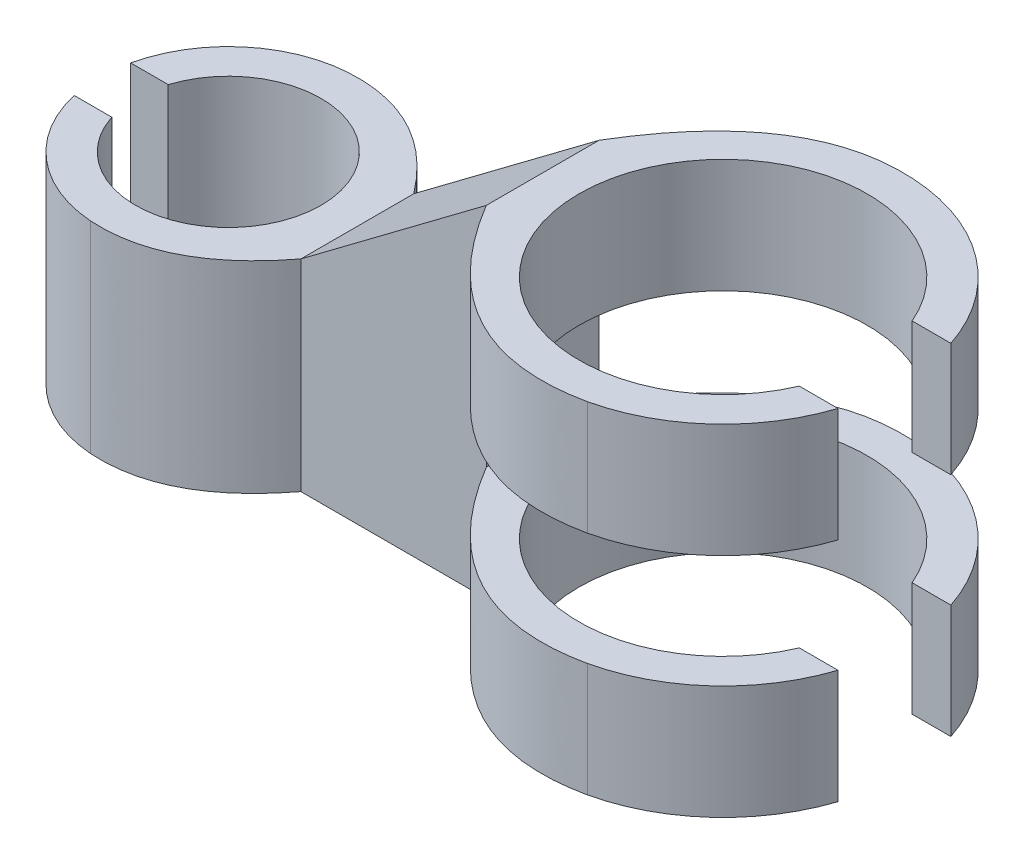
ISO-10303-21;
HEADER;
FILE_DESCRIPTION(('STEP AP214'),'2;1');
FILE_NAME('part.step','',(''),(''),'','','');
FILE_SCHEMA(('AUTOMOTIVE_DESIGN { 1 0 10303 214 1 1 1 1 }'));
ENDSEC;
DATA;
#1=APPLICATION_CONTEXT('core data for automotive mechanical design processes');
#2=APPLICATION_PROTOCOL_DEFINITION('international standard','automotive_design',2000,#1);
#3=PRODUCT_CONTEXT('',#1,'mechanical');
#4=PRODUCT('Part','Part','',(#3));
#5=PRODUCT_RELATED_PRODUCT_CATEGORY('part','',(#4));
#6=PRODUCT_DEFINITION_FORMATION('','',#4);
#7=PRODUCT_DEFINITION_CONTEXT('part definition',#1,'design');
#8=PRODUCT_DEFINITION('design','',#6,#7);
#9=PRODUCT_DEFINITION_SHAPE('','',#8);
#10=(LENGTH_UNIT() NAMED_UNIT(*) SI_UNIT(.MILLI.,.METRE.));
#11=(NAMED_UNIT(*) PLANE_ANGLE_UNIT() SI_UNIT($,.RADIAN.));
#12=(NAMED_UNIT(*) SI_UNIT($,.STERADIAN.) SOLID_ANGLE_UNIT());
#13=UNCERTAINTY_MEASURE_WITH_UNIT(LENGTH_MEASURE(1.E-05),#10,'distance_accuracy_value','');
#14=(GEOMETRIC_REPRESENTATION_CONTEXT(3) GLOBAL_UNCERTAINTY_ASSIGNED_CONTEXT((#13)) GLOBAL_UNIT_ASSIGNED_CONTEXT((#10,
#11,#12)) REPRESENTATION_CONTEXT('',''));
#15=CARTESIAN_POINT('',(0.,0.,0.));
#16=DIRECTION('',(0.,0.,1.));
#17=DIRECTION('',(1.,0.,0.));
#18=AXIS2_PLACEMENT_3D('',#15,#16,#17);
#19=CARTESIAN_POINT('',(20.4539037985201,16.9,2.33797950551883));
#20=DIRECTION('',(0.,-1.,0.));
#21=DIRECTION('',(0.,0.,-1.));
#22=AXIS2_PLACEMENT_3D('',#19,#20,#21);
#23=CYLINDRICAL_SURFACE('',#22,8.95);
#24=CARTESIAN_POINT('',(20.4539037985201,5.65,2.33797950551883));
#25=DIRECTION('',(0.,1.,0.));
#26=DIRECTION('',(0.,0.,1.));
#27=AXIS2_PLACEMENT_3D('',#24,#25,#26);
#28=CIRCLE('',#27,8.95);
#29=CARTESIAN_POINT('',(28.9546390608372,5.65,-0.462020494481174));
#30=VERTEX_POINT('',#29);
#31=CARTESIAN_POINT('',(22.4537820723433,5.65,-6.38572308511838));
#32=VERTEX_POINT('',#31);
#33=EDGE_CURVE('E507',#30,#32,#28,.T.);
#34=ORIENTED_EDGE('',*,*,#33,.F.);
#35=DIRECTION('',(0.,-1.,0.));
#36=VECTOR('',#35,1.);
#37=CARTESIAN_POINT('',(28.9546390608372,16.9,-0.462020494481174));
#38=LINE('',#37,#36);
#39=CARTESIAN_POINT('',(28.9546390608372,0.,-0.462020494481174));
#40=VERTEX_POINT('',#39);
#41=EDGE_CURVE('E55',#30,#40,#38,.T.);
#42=ORIENTED_EDGE('',*,*,#41,.T.);
#43=CARTESIAN_POINT('',(20.4539037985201,0.,2.33797950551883));
#44=DIRECTION('',(0.,-1.,0.));
#45=DIRECTION('',(0.,0.,-1.));
#46=AXIS2_PLACEMENT_3D('',#43,#44,#45);
#47=CIRCLE('',#46,8.95);
#48=CARTESIAN_POINT('',(22.4537820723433,0.,-6.38572308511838));
#49=VERTEX_POINT('',#48);
#50=EDGE_CURVE('E248',#40,#49,#47,.F.);
#51=ORIENTED_EDGE('',*,*,#50,.T.);
#52=DIRECTION('',(0.,-1.,0.));
#53=VECTOR('',#52,1.);
#54=CARTESIAN_POINT('',(22.4537820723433,16.9,-6.38572308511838));
#55=LINE('',#54,#53);
#56=EDGE_CURVE('E225',#32,#49,#55,.T.);
#57=ORIENTED_EDGE('',*,*,#56,.F.);
#58=EDGE_LOOP('',(#34,#42,#51,#57));
#59=FACE_BOUND('',#58,.T.);
#60=ADVANCED_FACE('F39',(#59),#23,.T.);
#61=CARTESIAN_POINT('',(20.4539037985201,16.9,2.33797950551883));
#62=DIRECTION('',(0.,-1.,0.));
#63=DIRECTION('',(0.,0.,-1.));
#64=AXIS2_PLACEMENT_3D('',#61,#62,#63);
#65=CIRCLE('',#64,8.95);
#66=CARTESIAN_POINT('',(28.9546390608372,16.9,-0.462020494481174));
#67=VERTEX_POINT('',#66);
#68=CARTESIAN_POINT('',(22.4537820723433,16.9,-6.38572308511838));
#69=VERTEX_POINT('',#68);
#70=EDGE_CURVE('E230',#67,#69,#65,.F.);
#71=ORIENTED_EDGE('',*,*,#70,.F.);
#72=DIRECTION('',(0.,-1.,0.));
#73=VECTOR('',#72,1.);
#74=CARTESIAN_POINT('',(28.9546390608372,16.9,-0.462020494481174));
#75=LINE('',#74,#73);
#76=CARTESIAN_POINT('',(28.9546390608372,11.25,-0.462020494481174));
#77=VERTEX_POINT('',#76);
#78=EDGE_CURVE('E545',#67,#77,#75,.T.);
#79=ORIENTED_EDGE('',*,*,#78,.T.);
#80=CARTESIAN_POINT('',(20.4539037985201,11.25,2.33797950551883));
#81=DIRECTION('',(0.,1.,0.));
#82=DIRECTION('',(0.,0.,1.));
#83=AXIS2_PLACEMENT_3D('',#80,#81,#82);
#84=CIRCLE('',#83,8.95);
#85=CARTESIAN_POINT('',(22.4537820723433,11.25,-6.38572308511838));
#86=VERTEX_POINT('',#85);
#87=EDGE_CURVE('E417',#77,#86,#84,.T.);
#88=ORIENTED_EDGE('',*,*,#87,.T.);
#89=EDGE_CURVE('E228',#69,#86,#55,.T.);
#90=ORIENTED_EDGE('',*,*,#89,.F.);
#91=EDGE_LOOP('',(#71,#79,#88,#90));
#92=FACE_BOUND('',#91,.T.);
#93=ADVANCED_FACE('F306',(#92),#23,.T.);
#94=CARTESIAN_POINT('',(-4.09609620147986,10.,2.33797950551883));
#95=DIRECTION('',(0.,-1.,0.));
#96=DIRECTION('',(0.,0.,-1.));
#97=AXIS2_PLACEMENT_3D('',#94,#95,#96);
#98=CYLINDRICAL_SURFACE('',#97,6.4);
#99=CARTESIAN_POINT('',(-4.09609620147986,0.,2.33797950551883));
#100=DIRECTION('',(0.,1.,0.));
#101=DIRECTION('',(0.,0.,1.));
#102=AXIS2_PLACEMENT_3D('',#99,#100,#101);
#103=CIRCLE('',#102,6.4);
#104=CARTESIAN_POINT('',(-4.53794079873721,0.,-4.0467501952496));
#105=VERTEX_POINT('',#104);
#106=CARTESIAN_POINT('',(-10.3410941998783,0.,0.937979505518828));
#107=VERTEX_POINT('',#106);
#108=EDGE_CURVE('E382',#105,#107,#103,.T.);
#109=ORIENTED_EDGE('',*,*,#108,.T.);
#110=DIRECTION('',(0.,-1.,0.));
#111=VECTOR('',#110,1.);
#112=CARTESIAN_POINT('',(-10.3410941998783,10.,0.937979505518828));
#113=LINE('',#112,#111);
#114=CARTESIAN_POINT('',(-10.3410941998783,10.,0.937979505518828));
#115=VERTEX_POINT('',#114);
#116=EDGE_CURVE('E476',#107,#115,#113,.F.);
#117=ORIENTED_EDGE('',*,*,#116,.T.);
#118=CARTESIAN_POINT('',(-4.09609620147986,10.,2.33797950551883));
#119=DIRECTION('',(0.,1.,0.));
#120=DIRECTION('',(0.,0.,1.));
#121=AXIS2_PLACEMENT_3D('',#118,#119,#120);
#122=CIRCLE('',#121,6.4);
#123=CARTESIAN_POINT('',(-4.53794079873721,10.,-4.0467501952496));
#124=VERTEX_POINT('',#123);
#125=EDGE_CURVE('E280',#124,#115,#122,.T.);
#126=ORIENTED_EDGE('',*,*,#125,.F.);
#127=DIRECTION('',(0.,-1.,0.));
#128=VECTOR('',#127,1.);
#129=CARTESIAN_POINT('',(-4.53794079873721,10.,-4.0467501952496));
#130=LINE('',#129,#128);
#131=EDGE_CURVE('E393',#124,#105,#130,.T.);
#132=ORIENTED_EDGE('',*,*,#131,.T.);
#133=EDGE_LOOP('',(#109,#117,#126,#132));
#134=FACE_BOUND('',#133,.T.);
#135=ADVANCED_FACE('F313',(#134),#98,.T.);
#136=CARTESIAN_POINT('',(11.5039037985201,16.9,5.13797950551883));
#137=CARTESIAN_POINT('',(15.8880562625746,16.9,12.4683931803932));
#138=CARTESIAN_POINT('',(22.4537820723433,16.9,11.061682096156));
#139=B_SPLINE_CURVE_WITH_KNOTS('',2,(#136,#137,#138),.UNSPECIFIED.,.F.,.F.,(3,3),(0.,1.),.UNSPECIFIED.);
#140=DIRECTION('',(0.,-1.,0.));
#141=VECTOR('',#140,1.);
#142=SURFACE_OF_LINEAR_EXTRUSION('',#139,#141);
#143=CARTESIAN_POINT('',(11.5039037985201,5.65,5.13797950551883));
#144=CARTESIAN_POINT('',(15.8880562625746,5.65,12.4683931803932));
#145=CARTESIAN_POINT('',(22.4537820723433,5.65,11.061682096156));
#146=B_SPLINE_CURVE_WITH_KNOTS('',2,(#143,#144,#145),.UNSPECIFIED.,.F.,.F.,(3,3),(0.,1.),.UNSPECIFIED.);
#147=CARTESIAN_POINT('',(11.5039037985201,5.65,5.13797950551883));
#148=VERTEX_POINT('',#147);
#149=CARTESIAN_POINT('',(22.4537820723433,5.65,11.061682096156));
#150=VERTEX_POINT('',#149);
#151=EDGE_CURVE('E358',#148,#150,#146,.T.);
#152=ORIENTED_EDGE('',*,*,#151,.F.);
#153=DIRECTION('',(0.,-1.,0.));
#154=VECTOR('',#153,1.);
#155=CARTESIAN_POINT('',(11.5039037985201,10.,5.13797950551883));
#156=LINE('',#155,#154);
#157=CARTESIAN_POINT('',(11.5039037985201,0.,5.13797950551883));
#158=VERTEX_POINT('',#157);
#159=EDGE_CURVE('E357',#148,#158,#156,.T.);
#160=ORIENTED_EDGE('',*,*,#159,.T.);
#161=CARTESIAN_POINT('',(11.5039037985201,0.,5.13797950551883));
#162=CARTESIAN_POINT('',(15.8880562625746,0.,12.4683931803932));
#163=CARTESIAN_POINT('',(22.4537820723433,0.,11.061682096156));
#164=B_SPLINE_CURVE_WITH_KNOTS('',2,(#161,#162,#163),.UNSPECIFIED.,.F.,.F.,(3,3),(0.,1.),.UNSPECIFIED.);
#165=CARTESIAN_POINT('',(22.4537820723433,0.,11.061682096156));
#166=VERTEX_POINT('',#165);
#167=EDGE_CURVE('E234',#158,#166,#164,.T.);
#168=ORIENTED_EDGE('',*,*,#167,.T.);
#169=DIRECTION('',(0.,-1.,0.));
#170=VECTOR('',#169,1.);
#171=CARTESIAN_POINT('',(22.4537820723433,16.9,11.061682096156));
#172=LINE('',#171,#170);
#173=EDGE_CURVE('E262',#150,#166,#172,.T.);
#174=ORIENTED_EDGE('',*,*,#173,.F.);
#175=EDGE_LOOP('',(#152,#160,#168,#174));
#176=FACE_BOUND('',#175,.T.);
#177=ADVANCED_FACE('F332',(#176),#142,.F.);
#178=CARTESIAN_POINT('',(28.9546390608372,0.,5.13797950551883));
#179=VERTEX_POINT('',#178);
#180=EDGE_CURVE('E249',#166,#179,#47,.F.);
#181=ORIENTED_EDGE('',*,*,#180,.T.);
#182=DIRECTION('',(0.,-1.,0.));
#183=VECTOR('',#182,1.);
#184=CARTESIAN_POINT('',(28.9546390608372,16.9,5.13797950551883));
#185=LINE('',#184,#183);
#186=CARTESIAN_POINT('',(28.9546390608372,5.65,5.13797950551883));
#187=VERTEX_POINT('',#186);
#188=EDGE_CURVE('E345',#179,#187,#185,.F.);
#189=ORIENTED_EDGE('',*,*,#188,.T.);
#190=EDGE_CURVE('E508',#150,#187,#28,.T.);
#191=ORIENTED_EDGE('',*,*,#190,.F.);
#192=ORIENTED_EDGE('',*,*,#173,.T.);
#193=EDGE_LOOP('',(#181,#189,#191,#192));
#194=FACE_BOUND('',#193,.T.);
#195=ADVANCED_FACE('F315',(#194),#23,.T.);
#196=CARTESIAN_POINT('',(11.5039037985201,16.9,-0.462020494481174));
#197=CARTESIAN_POINT('',(15.8880562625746,16.9,-7.7924341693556));
#198=CARTESIAN_POINT('',(22.4537820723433,16.9,-6.38572308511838));
#199=B_SPLINE_CURVE_WITH_KNOTS('',2,(#196,#197,#198),.UNSPECIFIED.,.F.,.F.,(3,3),(0.,1.),.UNSPECIFIED.);
#200=DIRECTION('',(0.,-1.,0.));
#201=VECTOR('',#200,1.);
#202=SURFACE_OF_LINEAR_EXTRUSION('',#199,#201);
#203=DIRECTION('',(0.,-1.,0.));
#204=VECTOR('',#203,1.);
#205=CARTESIAN_POINT('',(11.5039037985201,10.,-0.462020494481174));
#206=LINE('',#205,#204);
#207=CARTESIAN_POINT('',(11.5039037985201,5.65,-0.462020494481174));
#208=VERTEX_POINT('',#207);
#209=CARTESIAN_POINT('',(11.5039037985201,0.,-0.462020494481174));
#210=VERTEX_POINT('',#209);
#211=EDGE_CURVE('E399',#208,#210,#206,.T.);
#212=ORIENTED_EDGE('',*,*,#211,.F.);
#213=CARTESIAN_POINT('',(22.4537820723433,5.65,-6.38572308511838));
#214=CARTESIAN_POINT('',(15.8880562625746,5.65,-7.7924341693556));
#215=CARTESIAN_POINT('',(11.5039037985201,5.65,-0.462020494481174));
#216=B_SPLINE_CURVE_WITH_KNOTS('',2,(#213,#214,#215),.UNSPECIFIED.,.F.,.F.,(3,3),(0.,1.),.UNSPECIFIED.);
#217=EDGE_CURVE('E439',#32,#208,#216,.T.);
#218=ORIENTED_EDGE('',*,*,#217,.F.);
#219=ORIENTED_EDGE('',*,*,#56,.T.);
#220=CARTESIAN_POINT('',(11.5039037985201,0.,-0.462020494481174));
#221=CARTESIAN_POINT('',(15.8880562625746,0.,-7.7924341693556));
#222=CARTESIAN_POINT('',(22.4537820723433,0.,-6.38572308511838));
#223=B_SPLINE_CURVE_WITH_KNOTS('',2,(#220,#221,#222),.UNSPECIFIED.,.F.,.F.,(3,3),(0.,1.),.UNSPECIFIED.);
#224=EDGE_CURVE('E239',#210,#49,#223,.T.);
#225=ORIENTED_EDGE('',*,*,#224,.F.);
#226=EDGE_LOOP('',(#212,#218,#219,#225));
#227=FACE_BOUND('',#226,.T.);
#228=ADVANCED_FACE('F328',(#227),#202,.T.);
#229=CARTESIAN_POINT('',(20.4539037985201,16.9,2.33797950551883));
#230=DIRECTION('',(0.,-1.,0.));
#231=DIRECTION('',(0.,0.,-1.));
#232=AXIS2_PLACEMENT_3D('',#229,#230,#231);
#233=CYLINDRICAL_SURFACE('',#232,7.15);
#234=CARTESIAN_POINT('',(20.4539037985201,0.,2.33797950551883));
#235=DIRECTION('',(0.,-1.,0.));
#236=DIRECTION('',(0.,0.,-1.));
#237=AXIS2_PLACEMENT_3D('',#234,#235,#236);
#238=CIRCLE('',#237,7.15);
#239=CARTESIAN_POINT('',(27.0328474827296,0.,5.13797950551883));
#240=VERTEX_POINT('',#239);
#241=CARTESIAN_POINT('',(27.0328474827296,0.,-0.462020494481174));
#242=VERTEX_POINT('',#241);
#243=EDGE_CURVE('E255',#240,#242,#238,.T.);
#244=ORIENTED_EDGE('',*,*,#243,.T.);
#245=DIRECTION('',(0.,-1.,0.));
#246=VECTOR('',#245,1.);
#247=CARTESIAN_POINT('',(27.0328474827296,16.9,-0.462020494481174));
#248=LINE('',#247,#246);
#249=CARTESIAN_POINT('',(27.0328474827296,5.65,-0.462020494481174));
#250=VERTEX_POINT('',#249);
#251=EDGE_CURVE('E555',#242,#250,#248,.F.);
#252=ORIENTED_EDGE('',*,*,#251,.T.);
#253=CARTESIAN_POINT('',(20.4539037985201,5.65,2.33797950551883));
#254=DIRECTION('',(0.,1.,0.));
#255=DIRECTION('',(0.,0.,1.));
#256=AXIS2_PLACEMENT_3D('',#253,#254,#255);
#257=CIRCLE('',#256,7.15);
#258=CARTESIAN_POINT('',(27.0328474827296,5.65,5.13797950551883));
#259=VERTEX_POINT('',#258);
#260=EDGE_CURVE('E420',#259,#250,#257,.F.);
#261=ORIENTED_EDGE('',*,*,#260,.F.);
#262=DIRECTION('',(0.,-1.,0.));
#263=VECTOR('',#262,1.);
#264=CARTESIAN_POINT('',(27.0328474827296,16.9,5.13797950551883));
#265=LINE('',#264,#263);
#266=EDGE_CURVE('E63',#259,#240,#265,.T.);
#267=ORIENTED_EDGE('',*,*,#266,.T.);
#268=EDGE_LOOP('',(#244,#252,#261,#267));
#269=FACE_BOUND('',#268,.T.);
#270=ADVANCED_FACE('F302',(#269),#233,.F.);
#271=CARTESIAN_POINT('',(2.30390379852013,10.,5.13797950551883));
#272=CARTESIAN_POINT('',(-0.619440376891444,10.,8.97316679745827));
#273=CARTESIAN_POINT('',(-4.53794079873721,10.,8.72270920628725));
#274=B_SPLINE_CURVE_WITH_KNOTS('',2,(#271,#272,#273),.UNSPECIFIED.,.F.,.F.,(3,3),(0.,1.),.UNSPECIFIED.);
#275=DIRECTION('',(0.,-1.,0.));
#276=VECTOR('',#275,1.);
#277=SURFACE_OF_LINEAR_EXTRUSION('',#274,#276);
#278=CARTESIAN_POINT('',(2.30390379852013,0.,5.13797950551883));
#279=CARTESIAN_POINT('',(-0.619440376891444,0.,8.97316679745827));
#280=CARTESIAN_POINT('',(-4.53794079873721,0.,8.72270920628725));
#281=B_SPLINE_CURVE_WITH_KNOTS('',2,(#278,#279,#280),.UNSPECIFIED.,.F.,.F.,(3,3),(0.,1.),.UNSPECIFIED.);
#282=CARTESIAN_POINT('',(2.30390379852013,0.,5.13797950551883));
#283=VERTEX_POINT('',#282);
#284=CARTESIAN_POINT('',(-4.53794079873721,0.,8.72270920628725));
#285=VERTEX_POINT('',#284);
#286=EDGE_CURVE('E261',#283,#285,#281,.T.);
#287=ORIENTED_EDGE('',*,*,#286,.F.);
#288=DIRECTION('',(0.,-1.,0.));
#289=VECTOR('',#288,1.);
#290=CARTESIAN_POINT('',(2.30390379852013,10.,5.13797950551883));
#291=LINE('',#290,#289);
#292=CARTESIAN_POINT('',(2.30390379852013,10.,5.13797950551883));
#293=VERTEX_POINT('',#292);
#294=EDGE_CURVE('E366',#293,#283,#291,.T.);
#295=ORIENTED_EDGE('',*,*,#294,.F.);
#296=CARTESIAN_POINT('',(-4.53794079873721,10.,8.72270920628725));
#297=VERTEX_POINT('',#296);
#298=EDGE_CURVE('E264',#293,#297,#274,.T.);
#299=ORIENTED_EDGE('',*,*,#298,.T.);
#300=DIRECTION('',(0.,-1.,0.));
#301=VECTOR('',#300,1.);
#302=CARTESIAN_POINT('',(-4.53794079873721,10.,8.72270920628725));
#303=LINE('',#302,#301);
#304=EDGE_CURVE('E390',#297,#285,#303,.T.);
#305=ORIENTED_EDGE('',*,*,#304,.T.);
#306=EDGE_LOOP('',(#287,#295,#299,#305));
#307=FACE_BOUND('',#306,.T.);
#308=ADVANCED_FACE('F41',(#307),#277,.T.);
#309=CARTESIAN_POINT('',(0.,10.,5.13797950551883));
#310=DIRECTION('',(0.,0.,-1.));
#311=DIRECTION('',(-1.,0.,0.));
#312=AXIS2_PLACEMENT_3D('',#309,#310,#311);
#313=PLANE('',#312);
#314=DIRECTION('',(1.,0.,0.));
#315=VECTOR('',#314,1.);
#316=CARTESIAN_POINT('',(0.,0.,5.13797950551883));
#317=LINE('',#316,#315);
#318=EDGE_CURVE('E363',#283,#158,#317,.T.);
#319=ORIENTED_EDGE('',*,*,#318,.T.);
#320=ORIENTED_EDGE('',*,*,#159,.F.);
#321=DIRECTION('',(0.,1.,0.));
#322=VECTOR('',#321,1.);
#323=CARTESIAN_POINT('',(11.5039037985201,5.65,5.13797950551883));
#324=LINE('',#323,#322);
#325=CARTESIAN_POINT('',(11.5039037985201,11.25,5.13797950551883));
#326=VERTEX_POINT('',#325);
#327=EDGE_CURVE('E437',#148,#326,#324,.T.);
#328=ORIENTED_EDGE('',*,*,#327,.T.);
#329=CARTESIAN_POINT('',(11.5039037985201,16.9,5.13797950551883));
#330=VERTEX_POINT('',#329);
#331=EDGE_CURVE('E360',#330,#326,#156,.T.);
#332=ORIENTED_EDGE('',*,*,#331,.F.);
#333=DIRECTION('',(0.8,0.6,0.));
#334=VECTOR('',#333,1.);
#335=CARTESIAN_POINT('',(2.30390379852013,10.,5.13797950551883));
#336=LINE('',#335,#334);
#337=EDGE_CURVE('E440',#293,#330,#336,.T.);
#338=ORIENTED_EDGE('',*,*,#337,.F.);
#339=ORIENTED_EDGE('',*,*,#294,.T.);
#340=EDGE_LOOP('',(#319,#320,#328,#332,#338,#339));
#341=FACE_BOUND('',#340,.T.);
#342=ADVANCED_FACE('F295',(#341),#313,.F.);
#343=CARTESIAN_POINT('',(0.,10.,-0.462020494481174));
#344=DIRECTION('',(0.,0.,-1.));
#345=DIRECTION('',(-1.,0.,0.));
#346=AXIS2_PLACEMENT_3D('',#343,#344,#345);
#347=PLANE('',#346);
#348=DIRECTION('',(1.,0.,0.));
#349=VECTOR('',#348,1.);
#350=CARTESIAN_POINT('',(0.,0.,-0.462020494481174));
#351=LINE('',#350,#349);
#352=CARTESIAN_POINT('',(2.30390379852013,0.,-0.462020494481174));
#353=VERTEX_POINT('',#352);
#354=EDGE_CURVE('E369',#353,#210,#351,.T.);
#355=ORIENTED_EDGE('',*,*,#354,.F.);
#356=DIRECTION('',(0.,-1.,0.));
#357=VECTOR('',#356,1.);
#358=CARTESIAN_POINT('',(2.30390379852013,10.,-0.462020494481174));
#359=LINE('',#358,#357);
#360=CARTESIAN_POINT('',(2.30390379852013,10.,-0.462020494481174));
#361=VERTEX_POINT('',#360);
#362=EDGE_CURVE('E397',#361,#353,#359,.T.);
#363=ORIENTED_EDGE('',*,*,#362,.F.);
#364=DIRECTION('',(0.8,0.6,0.));
#365=VECTOR('',#364,1.);
#366=CARTESIAN_POINT('',(2.30390379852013,10.,-0.462020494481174));
#367=LINE('',#366,#365);
#368=CARTESIAN_POINT('',(11.5039037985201,16.9,-0.462020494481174));
#369=VERTEX_POINT('',#368);
#370=EDGE_CURVE('E436',#361,#369,#367,.T.);
#371=ORIENTED_EDGE('',*,*,#370,.T.);
#372=CARTESIAN_POINT('',(11.5039037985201,11.25,-0.462020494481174));
#373=VERTEX_POINT('',#372);
#374=EDGE_CURVE('E361',#369,#373,#206,.T.);
#375=ORIENTED_EDGE('',*,*,#374,.T.);
#376=DIRECTION('',(0.,1.,0.));
#377=VECTOR('',#376,1.);
#378=CARTESIAN_POINT('',(11.5039037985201,5.65,-0.462020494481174));
#379=LINE('',#378,#377);
#380=EDGE_CURVE('E430',#208,#373,#379,.T.);
#381=ORIENTED_EDGE('',*,*,#380,.F.);
#382=ORIENTED_EDGE('',*,*,#211,.T.);
#383=EDGE_LOOP('',(#355,#363,#371,#375,#381,#382));
#384=FACE_BOUND('',#383,.T.);
#385=ADVANCED_FACE('F291',(#384),#347,.T.);
#386=CARTESIAN_POINT('',(2.30390379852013,10.,-0.462020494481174));
#387=CARTESIAN_POINT('',(-0.619440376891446,10.,-4.29720778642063));
#388=CARTESIAN_POINT('',(-4.53794079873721,10.,-4.0467501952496));
#389=B_SPLINE_CURVE_WITH_KNOTS('',2,(#386,#387,#388),.UNSPECIFIED.,.F.,.F.,(3,3),(0.,1.),.UNSPECIFIED.);
#390=DIRECTION('',(0.,-1.,0.));
#391=VECTOR('',#390,1.);
#392=SURFACE_OF_LINEAR_EXTRUSION('',#389,#391);
#393=CARTESIAN_POINT('',(2.30390379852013,0.,-0.462020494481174));
#394=CARTESIAN_POINT('',(-0.619440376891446,0.,-4.29720778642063));
#395=CARTESIAN_POINT('',(-4.53794079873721,0.,-4.0467501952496));
#396=B_SPLINE_CURVE_WITH_KNOTS('',2,(#393,#394,#395),.UNSPECIFIED.,.F.,.F.,(3,3),(0.,1.),.UNSPECIFIED.);
#397=EDGE_CURVE('E372',#353,#105,#396,.T.);
#398=ORIENTED_EDGE('',*,*,#397,.T.);
#399=ORIENTED_EDGE('',*,*,#131,.F.);
#400=EDGE_CURVE('E270',#361,#124,#389,.T.);
#401=ORIENTED_EDGE('',*,*,#400,.F.);
#402=ORIENTED_EDGE('',*,*,#362,.T.);
#403=EDGE_LOOP('',(#398,#399,#401,#402));
#404=FACE_BOUND('',#403,.T.);
#405=ADVANCED_FACE('F286',(#404),#392,.F.);
#406=CARTESIAN_POINT('',(-10.3410941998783,10.,3.73797950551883));
#407=VERTEX_POINT('',#406);
#408=EDGE_CURVE('E279',#407,#297,#122,.T.);
#409=ORIENTED_EDGE('',*,*,#408,.F.);
#410=DIRECTION('',(0.,-1.,0.));
#411=VECTOR('',#410,1.);
#412=CARTESIAN_POINT('',(-10.3410941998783,10.,3.73797950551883));
#413=LINE('',#412,#411);
#414=CARTESIAN_POINT('',(-10.3410941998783,0.,3.73797950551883));
#415=VERTEX_POINT('',#414);
#416=EDGE_CURVE('E484',#407,#415,#413,.T.);
#417=ORIENTED_EDGE('',*,*,#416,.T.);
#418=EDGE_CURVE('E381',#415,#285,#103,.T.);
#419=ORIENTED_EDGE('',*,*,#418,.T.);
#420=ORIENTED_EDGE('',*,*,#304,.F.);
#421=EDGE_LOOP('',(#409,#417,#419,#420));
#422=FACE_BOUND('',#421,.T.);
#423=ADVANCED_FACE('F290',(#422),#98,.T.);
#424=CARTESIAN_POINT('',(-4.09609620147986,10.,2.33797950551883));
#425=DIRECTION('',(0.,-1.,0.));
#426=DIRECTION('',(0.,0.,-1.));
#427=AXIS2_PLACEMENT_3D('',#424,#425,#426);
#428=CYLINDRICAL_SURFACE('',#427,4.6);
#429=DIRECTION('',(0.,-1.,0.));
#430=VECTOR('',#429,1.);
#431=CARTESIAN_POINT('',(-8.47787666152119,10.,0.937979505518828));
#432=LINE('',#431,#430);
#433=CARTESIAN_POINT('',(-8.47787666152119,0.,0.937979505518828));
#434=VERTEX_POINT('',#433);
#435=CARTESIAN_POINT('',(-8.47787666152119,10.,0.937979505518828));
#436=VERTEX_POINT('',#435);
#437=EDGE_CURVE('E471',#434,#436,#432,.F.);
#438=ORIENTED_EDGE('',*,*,#437,.F.);
#439=CARTESIAN_POINT('',(-4.09609620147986,0.,2.33797950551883));
#440=DIRECTION('',(0.,1.,0.));
#441=DIRECTION('',(0.,0.,1.));
#442=AXIS2_PLACEMENT_3D('',#439,#440,#441);
#443=CIRCLE('',#442,4.6);
#444=CARTESIAN_POINT('',(-8.47787666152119,0.,3.73797950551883));
#445=VERTEX_POINT('',#444);
#446=EDGE_CURVE('E271',#445,#434,#443,.T.);
#447=ORIENTED_EDGE('',*,*,#446,.F.);
#448=DIRECTION('',(0.,-1.,0.));
#449=VECTOR('',#448,1.);
#450=CARTESIAN_POINT('',(-8.47787666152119,10.,3.73797950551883));
#451=LINE('',#450,#449);
#452=CARTESIAN_POINT('',(-8.47787666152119,10.,3.73797950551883));
#453=VERTEX_POINT('',#452);
#454=EDGE_CURVE('E486',#453,#445,#451,.T.);
#455=ORIENTED_EDGE('',*,*,#454,.F.);
#456=CARTESIAN_POINT('',(-4.09609620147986,10.,2.33797950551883));
#457=DIRECTION('',(0.,1.,0.));
#458=DIRECTION('',(0.,0.,1.));
#459=AXIS2_PLACEMENT_3D('',#456,#457,#458);
#460=CIRCLE('',#459,4.6);
#461=EDGE_CURVE('E394',#453,#436,#460,.T.);
#462=ORIENTED_EDGE('',*,*,#461,.T.);
#463=EDGE_LOOP('',(#438,#447,#455,#462));
#464=FACE_BOUND('',#463,.T.);
#465=ADVANCED_FACE('F459',(#464),#428,.F.);
#466=CARTESIAN_POINT('',(0.,10.,0.));
#467=DIRECTION('',(0.,1.,0.));
#468=DIRECTION('',(0.,0.,1.));
#469=AXIS2_PLACEMENT_3D('',#466,#467,#468);
#470=PLANE('',#469);
#471=DIRECTION('',(-1.,0.,0.));
#472=VECTOR('',#471,1.);
#473=CARTESIAN_POINT('',(0.,10.,0.937979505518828));
#474=LINE('',#473,#472);
#475=EDGE_CURVE('E497',#436,#115,#474,.T.);
#476=ORIENTED_EDGE('',*,*,#475,.F.);
#477=ORIENTED_EDGE('',*,*,#461,.F.);
#478=DIRECTION('',(1.,0.,0.));
#479=VECTOR('',#478,1.);
#480=CARTESIAN_POINT('',(0.,10.,3.73797950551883));
#481=LINE('',#480,#479);
#482=EDGE_CURVE('E477',#407,#453,#481,.T.);
#483=ORIENTED_EDGE('',*,*,#482,.F.);
#484=ORIENTED_EDGE('',*,*,#408,.T.);
#485=ORIENTED_EDGE('',*,*,#298,.F.);
#486=DIRECTION('',(0.,0.,-1.));
#487=VECTOR('',#486,1.);
#488=CARTESIAN_POINT('',(2.30390379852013,10.,5.13797950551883));
#489=LINE('',#488,#487);
#490=EDGE_CURVE('E240',#293,#361,#489,.T.);
#491=ORIENTED_EDGE('',*,*,#490,.T.);
#492=ORIENTED_EDGE('',*,*,#400,.T.);
#493=ORIENTED_EDGE('',*,*,#125,.T.);
#494=EDGE_LOOP('',(#476,#477,#483,#484,#485,#491,#492,#493));
#495=FACE_BOUND('',#494,.T.);
#496=ADVANCED_FACE('F456',(#495),#470,.T.);
#497=CARTESIAN_POINT('',(0.,0.,0.));
#498=DIRECTION('',(0.,1.,0.));
#499=DIRECTION('',(0.,0.,1.));
#500=AXIS2_PLACEMENT_3D('',#497,#498,#499);
#501=PLANE('',#500);
#502=ORIENTED_EDGE('',*,*,#50,.F.);
#503=DIRECTION('',(-1.,0.,0.));
#504=VECTOR('',#503,1.);
#505=CARTESIAN_POINT('',(0.,0.,-0.462020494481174));
#506=LINE('',#505,#504);
#507=EDGE_CURVE('E491',#40,#242,#506,.T.);
#508=ORIENTED_EDGE('',*,*,#507,.T.);
#509=ORIENTED_EDGE('',*,*,#243,.F.);
#510=DIRECTION('',(1.,0.,0.));
#511=VECTOR('',#510,1.);
#512=CARTESIAN_POINT('',(0.,0.,5.13797950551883));
#513=LINE('',#512,#511);
#514=EDGE_CURVE('E354',#240,#179,#513,.T.);
#515=ORIENTED_EDGE('',*,*,#514,.T.);
#516=ORIENTED_EDGE('',*,*,#180,.F.);
#517=ORIENTED_EDGE('',*,*,#167,.F.);
#518=ORIENTED_EDGE('',*,*,#318,.F.);
#519=ORIENTED_EDGE('',*,*,#286,.T.);
#520=ORIENTED_EDGE('',*,*,#418,.F.);
#521=DIRECTION('',(1.,0.,0.));
#522=VECTOR('',#521,1.);
#523=CARTESIAN_POINT('',(0.,0.,3.73797950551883));
#524=LINE('',#523,#522);
#525=EDGE_CURVE('E404',#415,#445,#524,.T.);
#526=ORIENTED_EDGE('',*,*,#525,.T.);
#527=ORIENTED_EDGE('',*,*,#446,.T.);
#528=DIRECTION('',(-1.,0.,0.));
#529=VECTOR('',#528,1.);
#530=CARTESIAN_POINT('',(0.,0.,0.937979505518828));
#531=LINE('',#530,#529);
#532=EDGE_CURVE('E407',#434,#107,#531,.T.);
#533=ORIENTED_EDGE('',*,*,#532,.T.);
#534=ORIENTED_EDGE('',*,*,#108,.F.);
#535=ORIENTED_EDGE('',*,*,#397,.F.);
#536=ORIENTED_EDGE('',*,*,#354,.T.);
#537=ORIENTED_EDGE('',*,*,#224,.T.);
#538=EDGE_LOOP('',(#502,#508,#509,#515,#516,#517,#518,#519,#520,#526,#527,#533,#534,#535,#536,#537));
#539=FACE_BOUND('',#538,.T.);
#540=ADVANCED_FACE('F329',(#539),#501,.F.);
#541=ORIENTED_EDGE('',*,*,#331,.T.);
#542=CARTESIAN_POINT('',(11.5039037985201,11.25,5.13797950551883));
#543=CARTESIAN_POINT('',(15.8880562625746,11.25,12.4683931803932));
#544=CARTESIAN_POINT('',(22.4537820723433,11.25,11.061682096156));
#545=B_SPLINE_CURVE_WITH_KNOTS('',2,(#542,#543,#544),.UNSPECIFIED.,.F.,.F.,(3,3),(0.,1.),.UNSPECIFIED.);
#546=CARTESIAN_POINT('',(22.4537820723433,11.25,11.061682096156));
#547=VERTEX_POINT('',#546);
#548=EDGE_CURVE('E422',#326,#547,#545,.T.);
#549=ORIENTED_EDGE('',*,*,#548,.T.);
#550=CARTESIAN_POINT('',(22.4537820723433,16.9,11.061682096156));
#551=VERTEX_POINT('',#550);
#552=EDGE_CURVE('E259',#551,#547,#172,.T.);
#553=ORIENTED_EDGE('',*,*,#552,.F.);
#554=EDGE_CURVE('E258',#330,#551,#139,.T.);
#555=ORIENTED_EDGE('',*,*,#554,.F.);
#556=EDGE_LOOP('',(#541,#549,#553,#555));
#557=FACE_BOUND('',#556,.T.);
#558=ADVANCED_FACE('F321',(#557),#142,.F.);
#559=CARTESIAN_POINT('',(28.9546390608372,11.25,5.13797950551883));
#560=VERTEX_POINT('',#559);
#561=EDGE_CURVE('E412',#547,#560,#84,.T.);
#562=ORIENTED_EDGE('',*,*,#561,.T.);
#563=DIRECTION('',(0.,-1.,0.));
#564=VECTOR('',#563,1.);
#565=CARTESIAN_POINT('',(28.9546390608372,16.9,5.13797950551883));
#566=LINE('',#565,#564);
#567=CARTESIAN_POINT('',(28.9546390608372,16.9,5.13797950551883));
#568=VERTEX_POINT('',#567);
#569=EDGE_CURVE('E210',#560,#568,#566,.F.);
#570=ORIENTED_EDGE('',*,*,#569,.T.);
#571=EDGE_CURVE('E220',#551,#568,#65,.F.);
#572=ORIENTED_EDGE('',*,*,#571,.F.);
#573=ORIENTED_EDGE('',*,*,#552,.T.);
#574=EDGE_LOOP('',(#562,#570,#572,#573));
#575=FACE_BOUND('',#574,.T.);
#576=ADVANCED_FACE('F309',(#575),#23,.T.);
#577=CARTESIAN_POINT('',(22.4537820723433,11.25,-6.38572308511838));
#578=CARTESIAN_POINT('',(15.8880562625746,11.25,-7.7924341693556));
#579=CARTESIAN_POINT('',(11.5039037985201,11.25,-0.462020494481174));
#580=B_SPLINE_CURVE_WITH_KNOTS('',2,(#577,#578,#579),.UNSPECIFIED.,.F.,.F.,(3,3),(0.,1.),.UNSPECIFIED.);
#581=EDGE_CURVE('E416',#86,#373,#580,.T.);
#582=ORIENTED_EDGE('',*,*,#581,.T.);
#583=ORIENTED_EDGE('',*,*,#374,.F.);
#584=EDGE_CURVE('E536',#369,#69,#199,.T.);
#585=ORIENTED_EDGE('',*,*,#584,.T.);
#586=ORIENTED_EDGE('',*,*,#89,.T.);
#587=EDGE_LOOP('',(#582,#583,#585,#586));
#588=FACE_BOUND('',#587,.T.);
#589=ADVANCED_FACE('F320',(#588),#202,.T.);
#590=CARTESIAN_POINT('',(20.4539037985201,11.25,2.33797950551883));
#591=DIRECTION('',(0.,1.,0.));
#592=DIRECTION('',(0.,0.,1.));
#593=AXIS2_PLACEMENT_3D('',#590,#591,#592);
#594=CIRCLE('',#593,7.15);
#595=CARTESIAN_POINT('',(27.0328474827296,11.25,5.13797950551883));
#596=VERTEX_POINT('',#595);
#597=CARTESIAN_POINT('',(27.0328474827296,11.25,-0.462020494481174));
#598=VERTEX_POINT('',#597);
#599=EDGE_CURVE('E414',#596,#598,#594,.F.);
#600=ORIENTED_EDGE('',*,*,#599,.T.);
#601=DIRECTION('',(0.,-1.,0.));
#602=VECTOR('',#601,1.);
#603=CARTESIAN_POINT('',(27.0328474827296,16.9,-0.462020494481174));
#604=LINE('',#603,#602);
#605=CARTESIAN_POINT('',(27.0328474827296,16.9,-0.462020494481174));
#606=VERTEX_POINT('',#605);
#607=EDGE_CURVE('E224',#598,#606,#604,.F.);
#608=ORIENTED_EDGE('',*,*,#607,.T.);
#609=CARTESIAN_POINT('',(20.4539037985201,16.9,2.33797950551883));
#610=DIRECTION('',(0.,-1.,0.));
#611=DIRECTION('',(0.,0.,-1.));
#612=AXIS2_PLACEMENT_3D('',#609,#610,#611);
#613=CIRCLE('',#612,7.15);
#614=CARTESIAN_POINT('',(27.0328474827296,16.9,5.13797950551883));
#615=VERTEX_POINT('',#614);
#616=EDGE_CURVE('E218',#615,#606,#613,.T.);
#617=ORIENTED_EDGE('',*,*,#616,.F.);
#618=DIRECTION('',(0.,-1.,0.));
#619=VECTOR('',#618,1.);
#620=CARTESIAN_POINT('',(27.0328474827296,16.9,5.13797950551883));
#621=LINE('',#620,#619);
#622=EDGE_CURVE('E200',#615,#596,#621,.T.);
#623=ORIENTED_EDGE('',*,*,#622,.T.);
#624=EDGE_LOOP('',(#600,#608,#617,#623));
#625=FACE_BOUND('',#624,.T.);
#626=ADVANCED_FACE('F223',(#625),#233,.F.);
#627=CARTESIAN_POINT('',(0.,16.9,0.));
#628=DIRECTION('',(0.,-1.,0.));
#629=DIRECTION('',(0.,0.,-1.));
#630=AXIS2_PLACEMENT_3D('',#627,#628,#629);
#631=PLANE('',#630);
#632=ORIENTED_EDGE('',*,*,#616,.T.);
#633=DIRECTION('',(-1.,0.,0.));
#634=VECTOR('',#633,1.);
#635=CARTESIAN_POINT('',(25.013022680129,16.9,-0.462020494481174));
#636=LINE('',#635,#634);
#637=EDGE_CURVE('E211',#67,#606,#636,.T.);
#638=ORIENTED_EDGE('',*,*,#637,.F.);
#639=ORIENTED_EDGE('',*,*,#70,.T.);
#640=ORIENTED_EDGE('',*,*,#584,.F.);
#641=DIRECTION('',(0.,0.,1.));
#642=VECTOR('',#641,1.);
#643=CARTESIAN_POINT('',(11.5039037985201,16.9,0.));
#644=LINE('',#643,#642);
#645=EDGE_CURVE('E451',#369,#330,#644,.T.);
#646=ORIENTED_EDGE('',*,*,#645,.T.);
#647=ORIENTED_EDGE('',*,*,#554,.T.);
#648=ORIENTED_EDGE('',*,*,#571,.T.);
#649=DIRECTION('',(1.,0.,0.));
#650=VECTOR('',#649,1.);
#651=CARTESIAN_POINT('',(25.013022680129,16.9,5.13797950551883));
#652=LINE('',#651,#650);
#653=EDGE_CURVE('E203',#615,#568,#652,.T.);
#654=ORIENTED_EDGE('',*,*,#653,.F.);
#655=EDGE_LOOP('',(#632,#638,#639,#640,#646,#647,#648,#654));
#656=FACE_BOUND('',#655,.T.);
#657=ADVANCED_FACE('F216',(#656),#631,.F.);
#658=CARTESIAN_POINT('',(2.30390379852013,10.,5.13797950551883));
#659=DIRECTION('',(-0.6,0.8,0.));
#660=DIRECTION('',(-0.8,-0.6,0.));
#661=AXIS2_PLACEMENT_3D('',#658,#659,#660);
#662=PLANE('',#661);
#663=ORIENTED_EDGE('',*,*,#370,.F.);
#664=ORIENTED_EDGE('',*,*,#490,.F.);
#665=ORIENTED_EDGE('',*,*,#337,.T.);
#666=ORIENTED_EDGE('',*,*,#645,.F.);
#667=EDGE_LOOP('',(#663,#664,#665,#666));
#668=FACE_BOUND('',#667,.T.);
#669=ADVANCED_FACE('F596',(#668),#662,.T.);
#670=CARTESIAN_POINT('',(11.5039037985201,5.65,0.));
#671=DIRECTION('',(-1.,0.,0.));
#672=DIRECTION('',(0.,0.,1.));
#673=AXIS2_PLACEMENT_3D('',#670,#671,#672);
#674=PLANE('',#673);
#675=DIRECTION('',(0.,0.,1.));
#676=VECTOR('',#675,1.);
#677=CARTESIAN_POINT('',(11.5039037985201,11.25,0.));
#678=LINE('',#677,#676);
#679=EDGE_CURVE('E520',#373,#326,#678,.T.);
#680=ORIENTED_EDGE('',*,*,#679,.T.);
#681=ORIENTED_EDGE('',*,*,#327,.F.);
#682=DIRECTION('',(0.,0.,1.));
#683=VECTOR('',#682,1.);
#684=CARTESIAN_POINT('',(11.5039037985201,5.65,0.));
#685=LINE('',#684,#683);
#686=EDGE_CURVE('E501',#208,#148,#685,.T.);
#687=ORIENTED_EDGE('',*,*,#686,.F.);
#688=ORIENTED_EDGE('',*,*,#380,.T.);
#689=EDGE_LOOP('',(#680,#681,#687,#688));
#690=FACE_BOUND('',#689,.T.);
#691=ADVANCED_FACE('F526',(#690),#674,.F.);
#692=CARTESIAN_POINT('',(0.,5.65,0.));
#693=DIRECTION('',(0.,1.,0.));
#694=DIRECTION('',(0.,0.,1.));
#695=AXIS2_PLACEMENT_3D('',#692,#693,#694);
#696=PLANE('',#695);
#697=DIRECTION('',(-1.,0.,0.));
#698=VECTOR('',#697,1.);
#699=CARTESIAN_POINT('',(0.,5.65,-0.462020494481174));
#700=LINE('',#699,#698);
#701=EDGE_CURVE('E549',#30,#250,#700,.T.);
#702=ORIENTED_EDGE('',*,*,#701,.F.);
#703=ORIENTED_EDGE('',*,*,#33,.T.);
#704=ORIENTED_EDGE('',*,*,#217,.T.);
#705=ORIENTED_EDGE('',*,*,#686,.T.);
#706=ORIENTED_EDGE('',*,*,#151,.T.);
#707=ORIENTED_EDGE('',*,*,#190,.T.);
#708=DIRECTION('',(1.,0.,0.));
#709=VECTOR('',#708,1.);
#710=CARTESIAN_POINT('',(0.,5.65,5.13797950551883));
#711=LINE('',#710,#709);
#712=EDGE_CURVE('E561',#259,#187,#711,.T.);
#713=ORIENTED_EDGE('',*,*,#712,.F.);
#714=ORIENTED_EDGE('',*,*,#260,.T.);
#715=EDGE_LOOP('',(#702,#703,#704,#705,#706,#707,#713,#714));
#716=FACE_BOUND('',#715,.T.);
#717=ADVANCED_FACE('F568',(#716),#696,.T.);
#718=CARTESIAN_POINT('',(0.,11.25,0.));
#719=DIRECTION('',(0.,1.,0.));
#720=DIRECTION('',(0.,0.,1.));
#721=AXIS2_PLACEMENT_3D('',#718,#719,#720);
#722=PLANE('',#721);
#723=ORIENTED_EDGE('',*,*,#87,.F.);
#724=DIRECTION('',(-1.,0.,0.));
#725=VECTOR('',#724,1.);
#726=CARTESIAN_POINT('',(0.,11.25,-0.462020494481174));
#727=LINE('',#726,#725);
#728=EDGE_CURVE('E11',#77,#598,#727,.T.);
#729=ORIENTED_EDGE('',*,*,#728,.T.);
#730=ORIENTED_EDGE('',*,*,#599,.F.);
#731=DIRECTION('',(1.,0.,0.));
#732=VECTOR('',#731,1.);
#733=CARTESIAN_POINT('',(0.,11.25,5.13797950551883));
#734=LINE('',#733,#732);
#735=EDGE_CURVE('E48',#596,#560,#734,.T.);
#736=ORIENTED_EDGE('',*,*,#735,.T.);
#737=ORIENTED_EDGE('',*,*,#561,.F.);
#738=ORIENTED_EDGE('',*,*,#548,.F.);
#739=ORIENTED_EDGE('',*,*,#679,.F.);
#740=ORIENTED_EDGE('',*,*,#581,.F.);
#741=EDGE_LOOP('',(#723,#729,#730,#736,#737,#738,#739,#740));
#742=FACE_BOUND('',#741,.T.);
#743=ADVANCED_FACE('F411',(#742),#722,.F.);
#744=CARTESIAN_POINT('',(-12.0850769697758,-1.70000000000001,3.73797950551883));
#745=DIRECTION('',(0.,0.,1.));
#746=DIRECTION('',(1.,0.,0.));
#747=AXIS2_PLACEMENT_3D('',#744,#745,#746);
#748=PLANE('',#747);
#749=ORIENTED_EDGE('',*,*,#482,.T.);
#750=ORIENTED_EDGE('',*,*,#454,.T.);
#751=ORIENTED_EDGE('',*,*,#525,.F.);
#752=ORIENTED_EDGE('',*,*,#416,.F.);
#753=EDGE_LOOP('',(#749,#750,#751,#752));
#754=FACE_BOUND('',#753,.T.);
#755=ADVANCED_FACE('F483',(#754),#748,.F.);
#756=CARTESIAN_POINT('',(-12.0850769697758,-1.70000000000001,0.937979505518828));
#757=DIRECTION('',(0.,0.,-1.));
#758=DIRECTION('',(-1.,0.,0.));
#759=AXIS2_PLACEMENT_3D('',#756,#757,#758);
#760=PLANE('',#759);
#761=ORIENTED_EDGE('',*,*,#475,.T.);
#762=ORIENTED_EDGE('',*,*,#116,.F.);
#763=ORIENTED_EDGE('',*,*,#532,.F.);
#764=ORIENTED_EDGE('',*,*,#437,.T.);
#765=EDGE_LOOP('',(#761,#762,#763,#764));
#766=FACE_BOUND('',#765,.T.);
#767=ADVANCED_FACE('F579',(#766),#760,.F.);
#768=CARTESIAN_POINT('',(25.013022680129,-1.70000000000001,5.13797950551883));
#769=DIRECTION('',(0.,0.,1.));
#770=DIRECTION('',(1.,0.,0.));
#771=AXIS2_PLACEMENT_3D('',#768,#769,#770);
#772=PLANE('',#771);
#773=ORIENTED_EDGE('',*,*,#735,.F.);
#774=ORIENTED_EDGE('',*,*,#622,.F.);
#775=ORIENTED_EDGE('',*,*,#653,.T.);
#776=ORIENTED_EDGE('',*,*,#569,.F.);
#777=EDGE_LOOP('',(#773,#774,#775,#776));
#778=FACE_BOUND('',#777,.T.);
#779=ADVANCED_FACE('F202',(#778),#772,.F.);
#780=CARTESIAN_POINT('',(25.013022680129,-1.70000000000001,-0.462020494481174));
#781=DIRECTION('',(0.,0.,-1.));
#782=DIRECTION('',(-1.,0.,0.));
#783=AXIS2_PLACEMENT_3D('',#780,#781,#782);
#784=PLANE('',#783);
#785=ORIENTED_EDGE('',*,*,#637,.T.);
#786=ORIENTED_EDGE('',*,*,#607,.F.);
#787=ORIENTED_EDGE('',*,*,#728,.F.);
#788=ORIENTED_EDGE('',*,*,#78,.F.);
#789=EDGE_LOOP('',(#785,#786,#787,#788));
#790=FACE_BOUND('',#789,.T.);
#791=ADVANCED_FACE('F547',(#790),#784,.F.);
#792=ORIENTED_EDGE('',*,*,#266,.F.);
#793=ORIENTED_EDGE('',*,*,#712,.T.);
#794=ORIENTED_EDGE('',*,*,#188,.F.);
#795=ORIENTED_EDGE('',*,*,#514,.F.);
#796=EDGE_LOOP('',(#792,#793,#794,#795));
#797=FACE_BOUND('',#796,.T.);
#798=ADVANCED_FACE('F566',(#797),#772,.F.);
#799=ORIENTED_EDGE('',*,*,#41,.F.);
#800=ORIENTED_EDGE('',*,*,#701,.T.);
#801=ORIENTED_EDGE('',*,*,#251,.F.);
#802=ORIENTED_EDGE('',*,*,#507,.F.);
#803=EDGE_LOOP('',(#799,#800,#801,#802));
#804=FACE_BOUND('',#803,.T.);
#805=ADVANCED_FACE('F738',(#804),#784,.F.);
#806=CLOSED_SHELL('',(#60,#93,#135,#177,#195,#228,#270,#308,#342,#385,#405,#423,#465,#496,#540,
#558,#576,#589,#626,#657,#669,#691,#717,#743,#755,#767,#779,#791,#798,#805));
#807=MANIFOLD_SOLID_BREP('B2',#806);
#808=ADVANCED_BREP_SHAPE_REPRESENTATION('',(#18,#807),#14);
#809=SHAPE_DEFINITION_REPRESENTATION(#9,#808);
ENDSEC;
END-ISO-10303-21;
